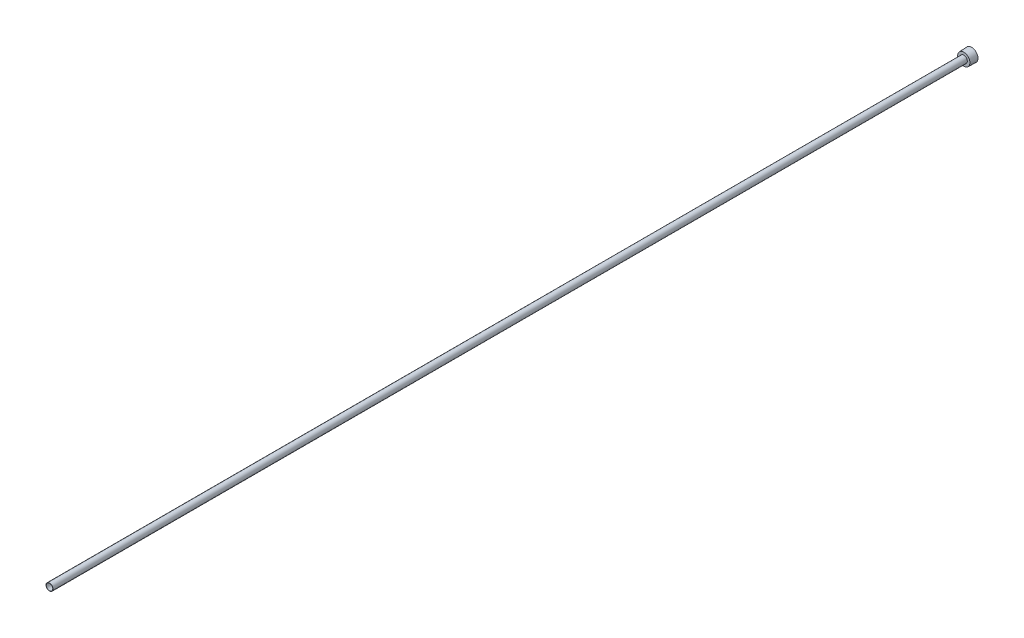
ISO-10303-21;
HEADER;
FILE_DESCRIPTION(('STEP AP214'),'2;1');
FILE_NAME('part.step','',(''),(''),'','','');
FILE_SCHEMA(('AUTOMOTIVE_DESIGN { 1 0 10303 214 1 1 1 1 }'));
ENDSEC;
DATA;
#1=APPLICATION_CONTEXT('core data for automotive mechanical design processes');
#2=APPLICATION_PROTOCOL_DEFINITION('international standard','automotive_design',2000,#1);
#3=PRODUCT_CONTEXT('',#1,'mechanical');
#4=PRODUCT('Part','Part','',(#3));
#5=PRODUCT_RELATED_PRODUCT_CATEGORY('part','',(#4));
#6=PRODUCT_DEFINITION_FORMATION('','',#4);
#7=PRODUCT_DEFINITION_CONTEXT('part definition',#1,'design');
#8=PRODUCT_DEFINITION('design','',#6,#7);
#9=PRODUCT_DEFINITION_SHAPE('','',#8);
#10=(LENGTH_UNIT() NAMED_UNIT(*) SI_UNIT(.MILLI.,.METRE.));
#11=(NAMED_UNIT(*) PLANE_ANGLE_UNIT() SI_UNIT($,.RADIAN.));
#12=(NAMED_UNIT(*) SI_UNIT($,.STERADIAN.) SOLID_ANGLE_UNIT());
#13=UNCERTAINTY_MEASURE_WITH_UNIT(LENGTH_MEASURE(1.E-05),#10,'distance_accuracy_value','');
#14=(GEOMETRIC_REPRESENTATION_CONTEXT(3) GLOBAL_UNCERTAINTY_ASSIGNED_CONTEXT((#13)) GLOBAL_UNIT_ASSIGNED_CONTEXT((#10,
#11,#12)) REPRESENTATION_CONTEXT('',''));
#15=CARTESIAN_POINT('',(0.,0.,0.));
#16=DIRECTION('',(0.,0.,1.));
#17=DIRECTION('',(1.,0.,0.));
#18=AXIS2_PLACEMENT_3D('',#15,#16,#17);
#19=CARTESIAN_POINT('',(0.,0.,0.));
#20=DIRECTION('',(0.,0.,1.));
#21=DIRECTION('',(1.,0.,0.));
#22=AXIS2_PLACEMENT_3D('',#19,#20,#21);
#23=CYLINDRICAL_SURFACE('',#22,4.318);
#24=CARTESIAN_POINT('',(0.,0.,1219.2));
#25=DIRECTION('',(0.,0.,1.));
#26=DIRECTION('',(1.,0.,0.));
#27=AXIS2_PLACEMENT_3D('',#24,#25,#26);
#28=CIRCLE('',#27,4.318);
#29=CARTESIAN_POINT('',(4.318,0.,1219.2));
#30=VERTEX_POINT('',#29);
#31=EDGE_CURVE('E142',#30,#30,#28,.T.);
#32=CARTESIAN_POINT('',(0.,0.,6.35));
#33=DIRECTION('',(0.,0.,-1.));
#34=DIRECTION('',(-1.,0.,0.));
#35=AXIS2_PLACEMENT_3D('',#32,#33,#34);
#36=CIRCLE('',#35,4.318);
#37=CARTESIAN_POINT('',(4.318,0.,6.35));
#38=VERTEX_POINT('',#37);
#39=EDGE_CURVE('E37',#38,#38,#36,.F.);
#40=CARTESIAN_POINT('',(4.318,0.,1219.2));
#41=CARTESIAN_POINT('',(4.318,0.,1206.56614583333));
#42=CARTESIAN_POINT('',(4.318,0.,1193.93229166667));
#43=CARTESIAN_POINT('',(4.318,0.,1168.66458333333));
#44=CARTESIAN_POINT('',(4.318,0.,1156.03072916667));
#45=CARTESIAN_POINT('',(4.318,0.,1130.76302083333));
#46=CARTESIAN_POINT('',(4.318,0.,1118.12916666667));
#47=CARTESIAN_POINT('',(4.318,0.,1092.86145833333));
#48=CARTESIAN_POINT('',(4.318,0.,1080.22760416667));
#49=CARTESIAN_POINT('',(4.318,0.,1054.95989583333));
#50=CARTESIAN_POINT('',(4.318,0.,1042.32604166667));
#51=CARTESIAN_POINT('',(4.318,0.,1017.05833333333));
#52=CARTESIAN_POINT('',(4.318,0.,1004.42447916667));
#53=CARTESIAN_POINT('',(4.318,0.,979.156770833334));
#54=CARTESIAN_POINT('',(4.318,0.,966.522916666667));
#55=CARTESIAN_POINT('',(4.318,0.,941.255208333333));
#56=CARTESIAN_POINT('',(4.318,0.,928.621354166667));
#57=CARTESIAN_POINT('',(4.318,0.,903.353645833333));
#58=CARTESIAN_POINT('',(4.318,0.,890.719791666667));
#59=CARTESIAN_POINT('',(4.318,0.,865.452083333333));
#60=CARTESIAN_POINT('',(4.318,0.,852.818229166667));
#61=CARTESIAN_POINT('',(4.318,0.,827.550520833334));
#62=CARTESIAN_POINT('',(4.318,0.,814.916666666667));
#63=CARTESIAN_POINT('',(4.318,0.,789.648958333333));
#64=CARTESIAN_POINT('',(4.318,0.,777.015104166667));
#65=CARTESIAN_POINT('',(4.318,0.,751.747395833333));
#66=CARTESIAN_POINT('',(4.318,0.,739.113541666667));
#67=CARTESIAN_POINT('',(4.318,0.,713.845833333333));
#68=CARTESIAN_POINT('',(4.318,0.,701.211979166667));
#69=CARTESIAN_POINT('',(4.318,0.,675.944270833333));
#70=CARTESIAN_POINT('',(4.318,0.,663.310416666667));
#71=CARTESIAN_POINT('',(4.318,0.,638.042708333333));
#72=CARTESIAN_POINT('',(4.318,0.,625.408854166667));
#73=CARTESIAN_POINT('',(4.318,0.,600.141145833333));
#74=CARTESIAN_POINT('',(4.318,0.,587.507291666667));
#75=CARTESIAN_POINT('',(4.318,0.,562.239583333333));
#76=CARTESIAN_POINT('',(4.318,0.,549.605729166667));
#77=CARTESIAN_POINT('',(4.318,0.,524.338020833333));
#78=CARTESIAN_POINT('',(4.318,0.,511.704166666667));
#79=CARTESIAN_POINT('',(4.318,0.,486.436458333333));
#80=CARTESIAN_POINT('',(4.318,0.,473.802604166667));
#81=CARTESIAN_POINT('',(4.318,0.,448.534895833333));
#82=CARTESIAN_POINT('',(4.318,0.,435.901041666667));
#83=CARTESIAN_POINT('',(4.318,0.,410.633333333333));
#84=CARTESIAN_POINT('',(4.318,0.,397.999479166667));
#85=CARTESIAN_POINT('',(4.318,0.,372.731770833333));
#86=CARTESIAN_POINT('',(4.318,0.,360.097916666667));
#87=CARTESIAN_POINT('',(4.318,0.,334.830208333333));
#88=CARTESIAN_POINT('',(4.318,0.,322.196354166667));
#89=CARTESIAN_POINT('',(4.318,0.,296.928645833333));
#90=CARTESIAN_POINT('',(4.318,0.,284.294791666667));
#91=CARTESIAN_POINT('',(4.318,0.,259.027083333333));
#92=CARTESIAN_POINT('',(4.318,0.,246.393229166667));
#93=CARTESIAN_POINT('',(4.318,0.,221.125520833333));
#94=CARTESIAN_POINT('',(4.318,0.,208.491666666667));
#95=CARTESIAN_POINT('',(4.318,0.,183.223958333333));
#96=CARTESIAN_POINT('',(4.318,0.,170.590104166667));
#97=CARTESIAN_POINT('',(4.318,0.,145.322395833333));
#98=CARTESIAN_POINT('',(4.318,0.,132.688541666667));
#99=CARTESIAN_POINT('',(4.318,0.,107.420833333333));
#100=CARTESIAN_POINT('',(4.318,0.,94.7869791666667));
#101=CARTESIAN_POINT('',(4.318,0.,69.5192708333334));
#102=CARTESIAN_POINT('',(4.318,0.,56.8854166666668));
#103=CARTESIAN_POINT('',(4.318,0.,31.6177083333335));
#104=CARTESIAN_POINT('',(4.318,0.,18.9838541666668));
#105=CARTESIAN_POINT('',(4.318,0.,6.35000000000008));
#106=B_SPLINE_CURVE_WITH_KNOTS('',3,(#40,#41,#42,#43,#44,#45,#46,#47,#48,#49,#50,#51,#52,#53,
#54,#55,#56,#57,#58,#59,#60,#61,#62,#63,#64,#65,#66,#67,#68,#69,#70,#71,#72,#73,#74,#75,#76,#77,
#78,#79,#80,#81,#82,#83,#84,#85,#86,#87,#88,#89,#90,#91,#92,#93,#94,#95,#96,#97,#98,#99,#100,
#101,#102,#103,#104,#105),.UNSPECIFIED.,.F.,.F.,(4,2,2,2,2,2,2,2,2,2,2,2,2,2,2,2,2,2,2,2,2,2,2,
2,2,2,2,2,2,2,2,2,4),(0.,37.9015625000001,75.803125,113.7046875,151.60625,189.5078125,
227.409375,265.3109375,303.2125,341.1140625,379.015625,416.9171875,454.81875,492.7203125,
530.621875,568.5234375,606.425,644.3265625,682.228125,720.1296875,758.03125,795.9328125,
833.834375,871.7359375,909.6375,947.5390625,985.440625,1023.3421875,1061.24375,1099.1453125,
1137.046875,1174.9484375,1212.85),.UNSPECIFIED.);
#107=EDGE_CURVE('BSEAM33',#30,#38,#106,.T.);
#108=ORIENTED_EDGE('',*,*,#31,.T.);
#109=ORIENTED_EDGE('',*,*,#39,.F.);
#110=ORIENTED_EDGE('',*,*,#107,.T.);
#111=ORIENTED_EDGE('',*,*,#107,.F.);
#112=EDGE_LOOP('',(#108,#110,#109,#111));
#113=FACE_BOUND('',#112,.T.);
#114=ADVANCED_FACE('F33',(#113),#23,.F.);
#115=CARTESIAN_POINT('',(0.,0.,0.));
#116=DIRECTION('',(0.,0.,-1.));
#117=DIRECTION('',(-1.,0.,0.));
#118=AXIS2_PLACEMENT_3D('',#115,#116,#117);
#119=CONICAL_SURFACE('',#118,8.4709,0.0364599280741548);
#120=CARTESIAN_POINT('',(0.,0.,10.3124));
#121=DIRECTION('',(0.,0.,1.));
#122=DIRECTION('',(1.,0.,0.));
#123=AXIS2_PLACEMENT_3D('',#120,#121,#122);
#124=CIRCLE('',#123,8.09474394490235);
#125=CARTESIAN_POINT('',(8.09474394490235,0.,10.3124));
#126=VERTEX_POINT('',#125);
#127=EDGE_CURVE('E11',#126,#126,#124,.T.);
#128=ORIENTED_EDGE('',*,*,#127,.F.);
#129=EDGE_LOOP('',(#128));
#130=FACE_BOUND('',#129,.T.);
#131=CARTESIAN_POINT('',(0.,0.,0.));
#132=DIRECTION('',(0.,0.,1.));
#133=DIRECTION('',(1.,0.,0.));
#134=AXIS2_PLACEMENT_3D('',#131,#132,#133);
#135=CIRCLE('',#134,8.4709);
#136=CARTESIAN_POINT('',(8.4709,0.,0.));
#137=VERTEX_POINT('',#136);
#138=EDGE_CURVE('E145',#137,#137,#135,.T.);
#139=ORIENTED_EDGE('',*,*,#138,.T.);
#140=EDGE_LOOP('',(#139));
#141=FACE_BOUND('',#140,.T.);
#142=ADVANCED_FACE('F35',(#130,#141),#119,.T.);
#143=CARTESIAN_POINT('',(0.,8.09474394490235,10.3124));
#144=DIRECTION('',(0.,0.,-1.));
#145=DIRECTION('',(-1.,0.,0.));
#146=AXIS2_PLACEMENT_3D('',#143,#144,#145);
#147=PLANE('',#146);
#148=CARTESIAN_POINT('',(0.,0.,10.3124));
#149=DIRECTION('',(0.,0.,1.));
#150=DIRECTION('',(1.,0.,0.));
#151=AXIS2_PLACEMENT_3D('',#148,#149,#150);
#152=CIRCLE('',#151,4.6355);
#153=CARTESIAN_POINT('',(4.6355,0.,10.3124));
#154=VERTEX_POINT('',#153);
#155=EDGE_CURVE('E42',#154,#154,#152,.T.);
#156=ORIENTED_EDGE('',*,*,#155,.F.);
#157=EDGE_LOOP('',(#156));
#158=FACE_BOUND('',#157,.T.);
#159=ORIENTED_EDGE('',*,*,#127,.T.);
#160=EDGE_LOOP('',(#159));
#161=FACE_BOUND('',#160,.T.);
#162=ADVANCED_FACE('F156',(#158,#161),#147,.F.);
#163=CARTESIAN_POINT('',(0.,0.,168.793426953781));
#164=DIRECTION('',(0.,0.,1.));
#165=DIRECTION('',(1.,0.,0.));
#166=AXIS2_PLACEMENT_3D('',#163,#164,#165);
#167=CYLINDRICAL_SURFACE('',#166,4.63549999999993);
#168=CARTESIAN_POINT('',(0.,0.,1219.2));
#169=DIRECTION('',(0.,0.,1.));
#170=DIRECTION('',(1.,0.,0.));
#171=AXIS2_PLACEMENT_3D('',#168,#169,#170);
#172=CIRCLE('',#171,4.63549999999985);
#173=CARTESIAN_POINT('',(4.63549999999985,0.,1219.2));
#174=VERTEX_POINT('',#173);
#175=EDGE_CURVE('E148',#174,#174,#172,.T.);
#176=ORIENTED_EDGE('',*,*,#175,.F.);
#177=EDGE_LOOP('',(#176));
#178=FACE_BOUND('',#177,.T.);
#179=ORIENTED_EDGE('',*,*,#155,.T.);
#180=EDGE_LOOP('',(#179));
#181=FACE_BOUND('',#180,.T.);
#182=ADVANCED_FACE('F154',(#178,#181),#167,.T.);
#183=CARTESIAN_POINT('',(0.,4.63549999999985,1219.2));
#184=DIRECTION('',(0.,0.,-1.));
#185=DIRECTION('',(-1.,0.,0.));
#186=AXIS2_PLACEMENT_3D('',#183,#184,#185);
#187=PLANE('',#186);
#188=ORIENTED_EDGE('',*,*,#31,.F.);
#189=EDGE_LOOP('',(#188));
#190=FACE_BOUND('',#189,.T.);
#191=ORIENTED_EDGE('',*,*,#175,.T.);
#192=EDGE_LOOP('',(#191));
#193=FACE_BOUND('',#192,.T.);
#194=ADVANCED_FACE('F167',(#190,#193),#187,.F.);
#195=CARTESIAN_POINT('',(0.,0.,0.));
#196=DIRECTION('',(0.,0.,1.));
#197=DIRECTION('',(1.,0.,0.));
#198=AXIS2_PLACEMENT_3D('',#195,#196,#197);
#199=PLANE('',#198);
#200=DIRECTION('',(-0.866025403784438,-0.5,0.));
#201=VECTOR('',#200,1.);
#202=CARTESIAN_POINT('',(4.7625,-2.74963065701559,0.));
#203=LINE('',#202,#201);
#204=CARTESIAN_POINT('',(4.7625,-2.74963065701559,0.));
#205=VERTEX_POINT('',#204);
#206=CARTESIAN_POINT('',(0.,-5.49926131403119,0.));
#207=VERTEX_POINT('',#206);
#208=EDGE_CURVE('E124',#205,#207,#203,.T.);
#209=ORIENTED_EDGE('',*,*,#208,.F.);
#210=DIRECTION('',(0.,-1.,0.));
#211=VECTOR('',#210,1.);
#212=CARTESIAN_POINT('',(4.7625,2.74963065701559,0.));
#213=LINE('',#212,#211);
#214=CARTESIAN_POINT('',(4.7625,2.74963065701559,0.));
#215=VERTEX_POINT('',#214);
#216=EDGE_CURVE('E49',#215,#205,#213,.T.);
#217=ORIENTED_EDGE('',*,*,#216,.F.);
#218=DIRECTION('',(0.866025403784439,-0.5,0.));
#219=VECTOR('',#218,1.);
#220=CARTESIAN_POINT('',(0.,5.49926131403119,0.));
#221=LINE('',#220,#219);
#222=CARTESIAN_POINT('',(0.,5.49926131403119,0.));
#223=VERTEX_POINT('',#222);
#224=EDGE_CURVE('E133',#223,#215,#221,.T.);
#225=ORIENTED_EDGE('',*,*,#224,.F.);
#226=DIRECTION('',(0.866025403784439,0.5,0.));
#227=VECTOR('',#226,1.);
#228=CARTESIAN_POINT('',(-4.7625,2.7496306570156,0.));
#229=LINE('',#228,#227);
#230=CARTESIAN_POINT('',(-4.7625,2.7496306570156,0.));
#231=VERTEX_POINT('',#230);
#232=EDGE_CURVE('E131',#231,#223,#229,.T.);
#233=ORIENTED_EDGE('',*,*,#232,.F.);
#234=DIRECTION('',(0.,1.,0.));
#235=VECTOR('',#234,1.);
#236=CARTESIAN_POINT('',(-4.7625,-2.74963065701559,0.));
#237=LINE('',#236,#235);
#238=CARTESIAN_POINT('',(-4.7625,-2.74963065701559,0.));
#239=VERTEX_POINT('',#238);
#240=EDGE_CURVE('E97',#239,#231,#237,.T.);
#241=ORIENTED_EDGE('',*,*,#240,.F.);
#242=DIRECTION('',(-0.866025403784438,0.5,0.));
#243=VECTOR('',#242,1.);
#244=CARTESIAN_POINT('',(0.,-5.49926131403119,0.));
#245=LINE('',#244,#243);
#246=EDGE_CURVE('E127',#207,#239,#245,.T.);
#247=ORIENTED_EDGE('',*,*,#246,.F.);
#248=EDGE_LOOP('',(#209,#217,#225,#233,#241,#247));
#249=FACE_BOUND('',#248,.T.);
#250=ORIENTED_EDGE('',*,*,#138,.F.);
#251=EDGE_LOOP('',(#250));
#252=FACE_BOUND('',#251,.T.);
#253=ADVANCED_FACE('F165',(#249,#252),#199,.F.);
#254=CARTESIAN_POINT('',(4.7625,-2.74963065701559,6.35));
#255=DIRECTION('',(0.,0.,-1.));
#256=DIRECTION('',(-1.,0.,0.));
#257=AXIS2_PLACEMENT_3D('',#254,#255,#256);
#258=PLANE('',#257);
#259=DIRECTION('',(0.,-1.,0.));
#260=VECTOR('',#259,1.);
#261=CARTESIAN_POINT('',(4.7625,2.74963065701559,6.35));
#262=LINE('',#261,#260);
#263=CARTESIAN_POINT('',(4.7625,2.74963065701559,6.35));
#264=VERTEX_POINT('',#263);
#265=CARTESIAN_POINT('',(4.7625,-2.74963065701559,6.35));
#266=VERTEX_POINT('',#265);
#267=EDGE_CURVE('E135',#264,#266,#262,.T.);
#268=ORIENTED_EDGE('',*,*,#267,.T.);
#269=DIRECTION('',(-0.866025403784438,-0.5,0.));
#270=VECTOR('',#269,1.);
#271=CARTESIAN_POINT('',(4.7625,-2.74963065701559,6.35));
#272=LINE('',#271,#270);
#273=CARTESIAN_POINT('',(0.,-5.49926131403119,6.35));
#274=VERTEX_POINT('',#273);
#275=EDGE_CURVE('E118',#266,#274,#272,.T.);
#276=ORIENTED_EDGE('',*,*,#275,.T.);
#277=DIRECTION('',(-0.866025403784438,0.5,0.));
#278=VECTOR('',#277,1.);
#279=CARTESIAN_POINT('',(0.,-5.49926131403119,6.35));
#280=LINE('',#279,#278);
#281=CARTESIAN_POINT('',(-4.7625,-2.74963065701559,6.35));
#282=VERTEX_POINT('',#281);
#283=EDGE_CURVE('E116',#274,#282,#280,.T.);
#284=ORIENTED_EDGE('',*,*,#283,.T.);
#285=DIRECTION('',(0.,1.,0.));
#286=VECTOR('',#285,1.);
#287=CARTESIAN_POINT('',(-4.7625,-2.74963065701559,6.35));
#288=LINE('',#287,#286);
#289=CARTESIAN_POINT('',(-4.7625,2.7496306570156,6.35));
#290=VERTEX_POINT('',#289);
#291=EDGE_CURVE('E94',#282,#290,#288,.T.);
#292=ORIENTED_EDGE('',*,*,#291,.T.);
#293=DIRECTION('',(0.866025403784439,0.5,0.));
#294=VECTOR('',#293,1.);
#295=CARTESIAN_POINT('',(-4.7625,2.7496306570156,6.35));
#296=LINE('',#295,#294);
#297=CARTESIAN_POINT('',(0.,5.49926131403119,6.35));
#298=VERTEX_POINT('',#297);
#299=EDGE_CURVE('E105',#290,#298,#296,.T.);
#300=ORIENTED_EDGE('',*,*,#299,.T.);
#301=DIRECTION('',(0.866025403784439,-0.5,0.));
#302=VECTOR('',#301,1.);
#303=CARTESIAN_POINT('',(0.,5.49926131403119,6.35));
#304=LINE('',#303,#302);
#305=EDGE_CURVE('E109',#298,#264,#304,.T.);
#306=ORIENTED_EDGE('',*,*,#305,.T.);
#307=EDGE_LOOP('',(#268,#276,#284,#292,#300,#306));
#308=FACE_BOUND('',#307,.T.);
#309=ORIENTED_EDGE('',*,*,#39,.T.);
#310=EDGE_LOOP('',(#309));
#311=FACE_BOUND('',#310,.T.);
#312=ADVANCED_FACE('F112',(#308,#311),#258,.T.);
#313=CARTESIAN_POINT('',(4.7625,2.74963065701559,6.35));
#314=DIRECTION('',(1.,0.,0.));
#315=DIRECTION('',(0.,0.,-1.));
#316=AXIS2_PLACEMENT_3D('',#313,#314,#315);
#317=PLANE('',#316);
#318=ORIENTED_EDGE('',*,*,#216,.T.);
#319=DIRECTION('',(0.,0.,-1.));
#320=VECTOR('',#319,1.);
#321=CARTESIAN_POINT('',(4.7625,-2.74963065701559,6.35));
#322=LINE('',#321,#320);
#323=EDGE_CURVE('E79',#266,#205,#322,.T.);
#324=ORIENTED_EDGE('',*,*,#323,.F.);
#325=ORIENTED_EDGE('',*,*,#267,.F.);
#326=DIRECTION('',(0.,0.,-1.));
#327=VECTOR('',#326,1.);
#328=CARTESIAN_POINT('',(4.7625,2.74963065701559,6.35));
#329=LINE('',#328,#327);
#330=EDGE_CURVE('E57',#264,#215,#329,.T.);
#331=ORIENTED_EDGE('',*,*,#330,.T.);
#332=EDGE_LOOP('',(#318,#324,#325,#331));
#333=FACE_BOUND('',#332,.T.);
#334=ADVANCED_FACE('F174',(#333),#317,.F.);
#335=CARTESIAN_POINT('',(0.,5.49926131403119,6.35));
#336=DIRECTION('',(0.5,0.866025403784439,0.));
#337=DIRECTION('',(-0.866025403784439,0.5,0.));
#338=AXIS2_PLACEMENT_3D('',#335,#336,#337);
#339=PLANE('',#338);
#340=ORIENTED_EDGE('',*,*,#224,.T.);
#341=ORIENTED_EDGE('',*,*,#330,.F.);
#342=ORIENTED_EDGE('',*,*,#305,.F.);
#343=DIRECTION('',(0.,0.,-1.));
#344=VECTOR('',#343,1.);
#345=CARTESIAN_POINT('',(0.,5.49926131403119,6.35));
#346=LINE('',#345,#344);
#347=EDGE_CURVE('E101',#298,#223,#346,.T.);
#348=ORIENTED_EDGE('',*,*,#347,.T.);
#349=EDGE_LOOP('',(#340,#341,#342,#348));
#350=FACE_BOUND('',#349,.T.);
#351=ADVANCED_FACE('F188',(#350),#339,.F.);
#352=CARTESIAN_POINT('',(-4.7625,2.7496306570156,6.35));
#353=DIRECTION('',(-0.5,0.866025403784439,0.));
#354=DIRECTION('',(-0.866025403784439,-0.5,0.));
#355=AXIS2_PLACEMENT_3D('',#352,#353,#354);
#356=PLANE('',#355);
#357=ORIENTED_EDGE('',*,*,#232,.T.);
#358=ORIENTED_EDGE('',*,*,#347,.F.);
#359=ORIENTED_EDGE('',*,*,#299,.F.);
#360=DIRECTION('',(0.,0.,-1.));
#361=VECTOR('',#360,1.);
#362=CARTESIAN_POINT('',(-4.7625,2.7496306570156,6.35));
#363=LINE('',#362,#361);
#364=EDGE_CURVE('E90',#290,#231,#363,.T.);
#365=ORIENTED_EDGE('',*,*,#364,.T.);
#366=EDGE_LOOP('',(#357,#358,#359,#365));
#367=FACE_BOUND('',#366,.T.);
#368=ADVANCED_FACE('F106',(#367),#356,.F.);
#369=CARTESIAN_POINT('',(-4.7625,-2.74963065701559,6.35));
#370=DIRECTION('',(-1.,0.,0.));
#371=DIRECTION('',(0.,0.,1.));
#372=AXIS2_PLACEMENT_3D('',#369,#370,#371);
#373=PLANE('',#372);
#374=ORIENTED_EDGE('',*,*,#240,.T.);
#375=ORIENTED_EDGE('',*,*,#364,.F.);
#376=ORIENTED_EDGE('',*,*,#291,.F.);
#377=DIRECTION('',(0.,0.,-1.));
#378=VECTOR('',#377,1.);
#379=CARTESIAN_POINT('',(-4.7625,-2.74963065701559,6.35));
#380=LINE('',#379,#378);
#381=EDGE_CURVE('E102',#282,#239,#380,.T.);
#382=ORIENTED_EDGE('',*,*,#381,.T.);
#383=EDGE_LOOP('',(#374,#375,#376,#382));
#384=FACE_BOUND('',#383,.T.);
#385=ADVANCED_FACE('F92',(#384),#373,.F.);
#386=CARTESIAN_POINT('',(0.,-5.49926131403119,6.35));
#387=DIRECTION('',(-0.5,-0.866025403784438,0.));
#388=DIRECTION('',(0.866025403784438,-0.5,0.));
#389=AXIS2_PLACEMENT_3D('',#386,#387,#388);
#390=PLANE('',#389);
#391=ORIENTED_EDGE('',*,*,#246,.T.);
#392=ORIENTED_EDGE('',*,*,#381,.F.);
#393=ORIENTED_EDGE('',*,*,#283,.F.);
#394=DIRECTION('',(0.,0.,-1.));
#395=VECTOR('',#394,1.);
#396=CARTESIAN_POINT('',(0.,-5.49926131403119,6.35));
#397=LINE('',#396,#395);
#398=EDGE_CURVE('E139',#274,#207,#397,.T.);
#399=ORIENTED_EDGE('',*,*,#398,.T.);
#400=EDGE_LOOP('',(#391,#392,#393,#399));
#401=FACE_BOUND('',#400,.T.);
#402=ADVANCED_FACE('F192',(#401),#390,.F.);
#403=CARTESIAN_POINT('',(4.7625,-2.74963065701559,6.35));
#404=DIRECTION('',(0.5,-0.866025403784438,0.));
#405=DIRECTION('',(0.866025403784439,0.5,0.));
#406=AXIS2_PLACEMENT_3D('',#403,#404,#405);
#407=PLANE('',#406);
#408=ORIENTED_EDGE('',*,*,#208,.T.);
#409=ORIENTED_EDGE('',*,*,#398,.F.);
#410=ORIENTED_EDGE('',*,*,#275,.F.);
#411=ORIENTED_EDGE('',*,*,#323,.T.);
#412=EDGE_LOOP('',(#408,#409,#410,#411));
#413=FACE_BOUND('',#412,.T.);
#414=ADVANCED_FACE('F189',(#413),#407,.F.);
#415=CLOSED_SHELL('',(#114,#142,#162,#182,#194,#253,#312,#334,#351,#368,#385,#402,#414));
#416=MANIFOLD_SOLID_BREP('B2',#415);
#417=ADVANCED_BREP_SHAPE_REPRESENTATION('',(#18,#416),#14);
#418=SHAPE_DEFINITION_REPRESENTATION(#9,#417);
ENDSEC;
END-ISO-10303-21;
